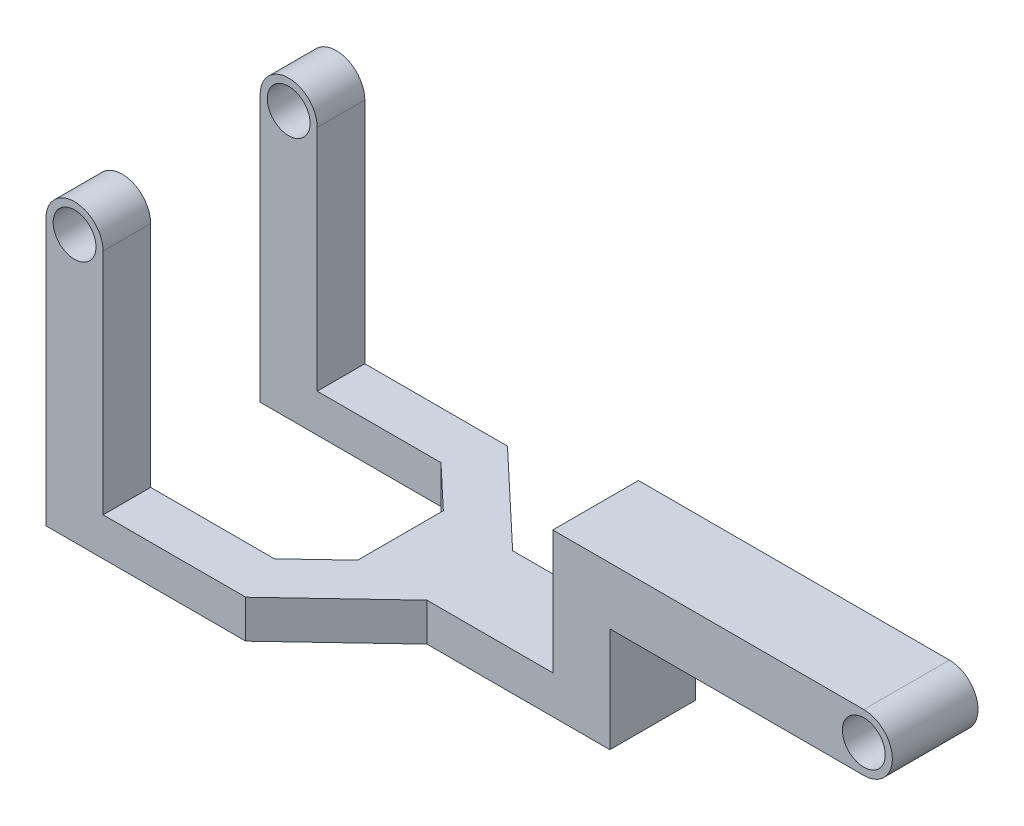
from build123d import *

# Parameters (mm, degrees)
ESQUISSE1_R                  = 22.5
BOSS_EXTRU_1_DEPTH           = 275
ENL_V_MAT_EXTRU_1_DEPTH      = 275
ENL_V_MAT_EXTRU_1_DEPTH_BACK = 275


with BuildPart() as part:
    # Esquisse1 → Boss.-Extru.1 (new body)
    with BuildSketch(Plane.XY):
        with BuildLine():
            Line((0, 280), (0, 0))
            Line((0, 0), (500, 0))
            Line((500, 0), (500, 110))
            Line((500, 110), (766.800007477, 110))
            ThreePointArc((766.800007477, 110), (796.8, 140.000003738), (766.8, 170))
            Line((766.8, 170), (440, 170))
            Line((440, 170), (440, 40))
            Line((440, 40), (60, 40))
            Line((60, 40), (60, 280))
            ThreePointArc((60, 280), (30, 310), (0, 280))
        make_face()
        with Locations((30, 280)):
            Circle(ESQUISSE1_R, mode=Mode.SUBTRACT)
        with Locations((766.8, 140)):
            Circle(ESQUISSE1_R, mode=Mode.SUBTRACT)
    extrude(amount=BOSS_EXTRU_1_DEPTH)

    # Esquisse2 → Enl_v. mat.-Extru.1 (cut, two sides: drawn at the far end of the back side and taken through both)
    with BuildSketch(Plane(origin=(0, 40, 0), x_dir=(1, 0, 0), z_dir=(0, 1, 0)).offset(-ENL_V_MAT_EXTRU_1_DEPTH_BACK)):
        Polygon((0, -50), (190, -50), (235, -92.5), (235, -182.5), (190, -225), (0, -225), align=None)
        Polygon((209.878931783, 0), (307.820108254, -92.5), (909.878931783, -92.5), (909.878931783, 0), align=None)
        Polygon((909.878931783, -182.5), (909.878931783, -275), (209.878931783, -275), (307.820108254, -182.5), align=None)
    extrude(amount=ENL_V_MAT_EXTRU_1_DEPTH + ENL_V_MAT_EXTRU_1_DEPTH_BACK, mode=Mode.SUBTRACT)


solid = part.part
